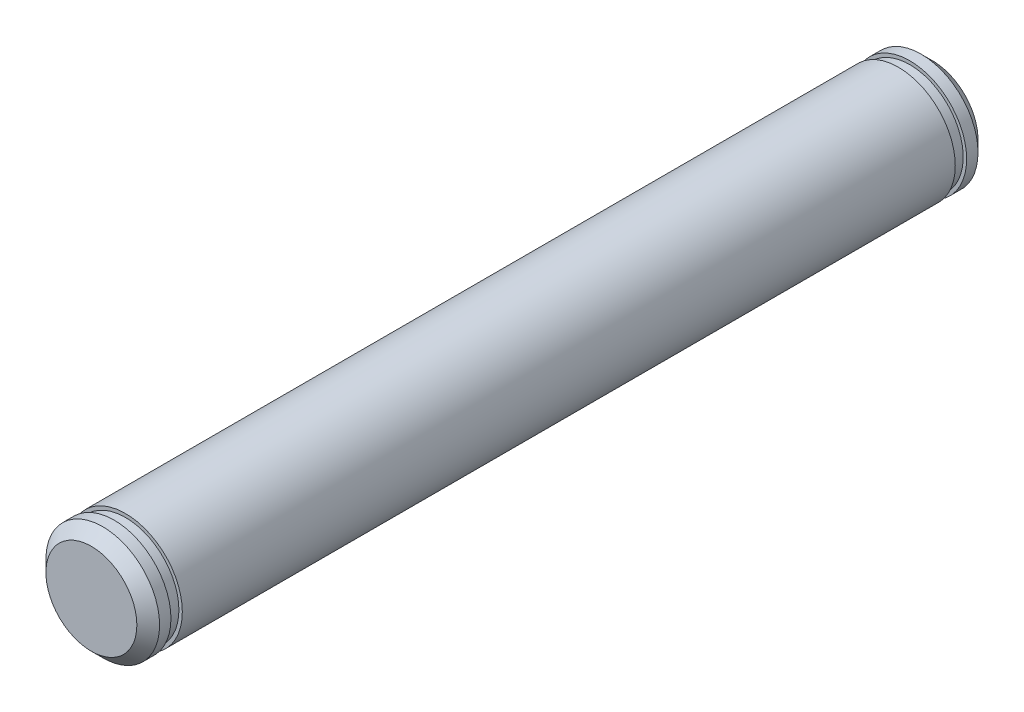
ISO-10303-21;
HEADER;
FILE_DESCRIPTION(('STEP AP214'),'2;1');
FILE_NAME('part.step','',(''),(''),'','','');
FILE_SCHEMA(('AUTOMOTIVE_DESIGN { 1 0 10303 214 1 1 1 1 }'));
ENDSEC;
DATA;
#1=APPLICATION_CONTEXT('core data for automotive mechanical design processes');
#2=APPLICATION_PROTOCOL_DEFINITION('international standard','automotive_design',2000,#1);
#3=PRODUCT_CONTEXT('',#1,'mechanical');
#4=PRODUCT('Part','Part','',(#3));
#5=PRODUCT_RELATED_PRODUCT_CATEGORY('part','',(#4));
#6=PRODUCT_DEFINITION_FORMATION('','',#4);
#7=PRODUCT_DEFINITION_CONTEXT('part definition',#1,'design');
#8=PRODUCT_DEFINITION('design','',#6,#7);
#9=PRODUCT_DEFINITION_SHAPE('','',#8);
#10=(LENGTH_UNIT() NAMED_UNIT(*) SI_UNIT(.MILLI.,.METRE.));
#11=(NAMED_UNIT(*) PLANE_ANGLE_UNIT() SI_UNIT($,.RADIAN.));
#12=(NAMED_UNIT(*) SI_UNIT($,.STERADIAN.) SOLID_ANGLE_UNIT());
#13=UNCERTAINTY_MEASURE_WITH_UNIT(LENGTH_MEASURE(1.E-05),#10,'distance_accuracy_value','');
#14=(GEOMETRIC_REPRESENTATION_CONTEXT(3) GLOBAL_UNCERTAINTY_ASSIGNED_CONTEXT((#13)) GLOBAL_UNIT_ASSIGNED_CONTEXT((#10,
#11,#12)) REPRESENTATION_CONTEXT('',''));
#15=CARTESIAN_POINT('',(0.,0.,0.));
#16=DIRECTION('',(0.,0.,1.));
#17=DIRECTION('',(1.,0.,0.));
#18=AXIS2_PLACEMENT_3D('',#15,#16,#17);
#19=CARTESIAN_POINT('',(0.,0.,34.));
#20=DIRECTION('',(0.,0.,1.));
#21=DIRECTION('',(1.,0.,0.));
#22=AXIS2_PLACEMENT_3D('',#19,#20,#21);
#23=PLANE('',#22);
#24=CARTESIAN_POINT('',(0.,0.,34.));
#25=DIRECTION('',(0.,0.,1.));
#26=DIRECTION('',(1.,0.,0.));
#27=AXIS2_PLACEMENT_3D('',#24,#25,#26);
#28=CIRCLE('',#27,5.);
#29=CARTESIAN_POINT('',(5.,0.,34.));
#30=VERTEX_POINT('',#29);
#31=EDGE_CURVE('E52',#30,#30,#28,.T.);
#32=ORIENTED_EDGE('',*,*,#31,.T.);
#33=EDGE_LOOP('',(#32));
#34=FACE_BOUND('',#33,.T.);
#35=CARTESIAN_POINT('',(0.,0.,34.));
#36=DIRECTION('',(0.,0.,1.));
#37=DIRECTION('',(1.,0.,0.));
#38=AXIS2_PLACEMENT_3D('',#35,#36,#37);
#39=CIRCLE('',#38,4.7);
#40=CARTESIAN_POINT('',(4.7,0.,34.));
#41=VERTEX_POINT('',#40);
#42=EDGE_CURVE('E58',#41,#41,#39,.T.);
#43=ORIENTED_EDGE('',*,*,#42,.F.);
#44=EDGE_LOOP('',(#43));
#45=FACE_BOUND('',#44,.T.);
#46=ADVANCED_FACE('F29',(#34,#45),#23,.T.);
#47=CARTESIAN_POINT('',(0.,0.,34.));
#48=DIRECTION('',(0.,0.,-1.));
#49=DIRECTION('',(-1.,0.,0.));
#50=AXIS2_PLACEMENT_3D('',#47,#48,#49);
#51=CYLINDRICAL_SURFACE('',#50,5.);
#52=ORIENTED_EDGE('',*,*,#31,.F.);
#53=EDGE_LOOP('',(#52));
#54=FACE_BOUND('',#53,.T.);
#55=CARTESIAN_POINT('',(0.,0.,-34.));
#56=DIRECTION('',(0.,0.,1.));
#57=DIRECTION('',(1.,0.,0.));
#58=AXIS2_PLACEMENT_3D('',#55,#56,#57);
#59=CIRCLE('',#58,5.);
#60=CARTESIAN_POINT('',(5.,0.,-34.));
#61=VERTEX_POINT('',#60);
#62=EDGE_CURVE('E64',#61,#61,#59,.T.);
#63=ORIENTED_EDGE('',*,*,#62,.T.);
#64=EDGE_LOOP('',(#63));
#65=FACE_BOUND('',#64,.T.);
#66=ADVANCED_FACE('F31',(#54,#65),#51,.T.);
#67=CARTESIAN_POINT('',(0.,0.,35.));
#68=DIRECTION('',(0.,0.,-1.));
#69=DIRECTION('',(-1.,0.,0.));
#70=AXIS2_PLACEMENT_3D('',#67,#68,#69);
#71=CYLINDRICAL_SURFACE('',#70,4.7);
#72=CARTESIAN_POINT('',(0.,0.,35.));
#73=DIRECTION('',(0.,0.,1.));
#74=DIRECTION('',(1.,0.,0.));
#75=AXIS2_PLACEMENT_3D('',#72,#73,#74);
#76=CIRCLE('',#75,4.7);
#77=CARTESIAN_POINT('',(4.7,0.,35.));
#78=VERTEX_POINT('',#77);
#79=EDGE_CURVE('E55',#78,#78,#76,.T.);
#80=ORIENTED_EDGE('',*,*,#79,.F.);
#81=EDGE_LOOP('',(#80));
#82=FACE_BOUND('',#81,.T.);
#83=ORIENTED_EDGE('',*,*,#42,.T.);
#84=EDGE_LOOP('',(#83));
#85=FACE_BOUND('',#84,.T.);
#86=ADVANCED_FACE('F94',(#82,#85),#71,.T.);
#87=CARTESIAN_POINT('',(0.,0.,35.));
#88=DIRECTION('',(0.,0.,1.));
#89=DIRECTION('',(1.,0.,0.));
#90=AXIS2_PLACEMENT_3D('',#87,#88,#89);
#91=PLANE('',#90);
#92=CARTESIAN_POINT('',(0.,0.,35.));
#93=DIRECTION('',(0.,0.,1.));
#94=DIRECTION('',(1.,0.,0.));
#95=AXIS2_PLACEMENT_3D('',#92,#93,#94);
#96=CIRCLE('',#95,5.);
#97=CARTESIAN_POINT('',(5.,0.,35.));
#98=VERTEX_POINT('',#97);
#99=EDGE_CURVE('E61',#98,#98,#96,.T.);
#100=ORIENTED_EDGE('',*,*,#99,.F.);
#101=EDGE_LOOP('',(#100));
#102=FACE_BOUND('',#101,.T.);
#103=ORIENTED_EDGE('',*,*,#79,.T.);
#104=EDGE_LOOP('',(#103));
#105=FACE_BOUND('',#104,.T.);
#106=ADVANCED_FACE('F100',(#102,#105),#91,.F.);
#107=CARTESIAN_POINT('',(0.,0.,37.));
#108=DIRECTION('',(0.,0.,-1.));
#109=DIRECTION('',(-1.,0.,0.));
#110=AXIS2_PLACEMENT_3D('',#107,#108,#109);
#111=CYLINDRICAL_SURFACE('',#110,5.);
#112=CARTESIAN_POINT('',(0.,0.,36.));
#113=DIRECTION('',(0.,0.,1.));
#114=DIRECTION('',(1.,0.,0.));
#115=AXIS2_PLACEMENT_3D('',#112,#113,#114);
#116=CIRCLE('',#115,5.);
#117=CARTESIAN_POINT('',(5.,0.,36.));
#118=VERTEX_POINT('',#117);
#119=EDGE_CURVE('E44',#118,#118,#116,.F.);
#120=ORIENTED_EDGE('',*,*,#119,.T.);
#121=EDGE_LOOP('',(#120));
#122=FACE_BOUND('',#121,.T.);
#123=ORIENTED_EDGE('',*,*,#99,.T.);
#124=EDGE_LOOP('',(#123));
#125=FACE_BOUND('',#124,.T.);
#126=ADVANCED_FACE('F102',(#122,#125),#111,.T.);
#127=CARTESIAN_POINT('',(0.,0.,37.));
#128=DIRECTION('',(0.,0.,1.));
#129=DIRECTION('',(1.,0.,0.));
#130=AXIS2_PLACEMENT_3D('',#127,#128,#129);
#131=PLANE('',#130);
#132=CARTESIAN_POINT('',(0.,0.,37.));
#133=DIRECTION('',(0.,0.,1.));
#134=DIRECTION('',(1.,0.,0.));
#135=AXIS2_PLACEMENT_3D('',#132,#133,#134);
#136=CIRCLE('',#135,3.99999999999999);
#137=CARTESIAN_POINT('',(3.99999999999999,0.,37.));
#138=VERTEX_POINT('',#137);
#139=EDGE_CURVE('E49',#138,#138,#136,.T.);
#140=ORIENTED_EDGE('',*,*,#139,.T.);
#141=EDGE_LOOP('',(#140));
#142=FACE_BOUND('',#141,.T.);
#143=ADVANCED_FACE('F105',(#142),#131,.T.);
#144=CARTESIAN_POINT('',(0.,0.,37.));
#145=DIRECTION('',(0.,0.,-1.));
#146=DIRECTION('',(-1.,0.,0.));
#147=AXIS2_PLACEMENT_3D('',#144,#145,#146);
#148=CONICAL_SURFACE('',#147,3.99999999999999,0.785398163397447);
#149=ORIENTED_EDGE('',*,*,#119,.F.);
#150=EDGE_LOOP('',(#149));
#151=FACE_BOUND('',#150,.T.);
#152=ORIENTED_EDGE('',*,*,#139,.F.);
#153=EDGE_LOOP('',(#152));
#154=FACE_BOUND('',#153,.T.);
#155=ADVANCED_FACE('F109',(#151,#154),#148,.T.);
#156=CARTESIAN_POINT('',(0.,0.,-34.));
#157=DIRECTION('',(0.,0.,-1.));
#158=DIRECTION('',(1.,0.,0.));
#159=AXIS2_PLACEMENT_3D('',#156,#157,#158);
#160=PLANE('',#159);
#161=CARTESIAN_POINT('',(0.,0.,-34.));
#162=DIRECTION('',(0.,0.,-1.));
#163=DIRECTION('',(-1.,0.,0.));
#164=AXIS2_PLACEMENT_3D('',#161,#162,#163);
#165=CIRCLE('',#164,4.7);
#166=CARTESIAN_POINT('',(-4.7,0.,-34.));
#167=VERTEX_POINT('',#166);
#168=EDGE_CURVE('E40',#167,#167,#165,.T.);
#169=ORIENTED_EDGE('',*,*,#168,.F.);
#170=EDGE_LOOP('',(#169));
#171=FACE_BOUND('',#170,.T.);
#172=ORIENTED_EDGE('',*,*,#62,.F.);
#173=EDGE_LOOP('',(#172));
#174=FACE_BOUND('',#173,.T.);
#175=ADVANCED_FACE('F86',(#171,#174),#160,.T.);
#176=CARTESIAN_POINT('',(0.,0.,-35.));
#177=DIRECTION('',(0.,0.,1.));
#178=DIRECTION('',(1.,0.,0.));
#179=AXIS2_PLACEMENT_3D('',#176,#177,#178);
#180=CYLINDRICAL_SURFACE('',#179,4.7);
#181=CARTESIAN_POINT('',(0.,0.,-35.));
#182=DIRECTION('',(0.,0.,-1.));
#183=DIRECTION('',(-1.,0.,0.));
#184=AXIS2_PLACEMENT_3D('',#181,#182,#183);
#185=CIRCLE('',#184,4.7);
#186=CARTESIAN_POINT('',(-4.7,0.,-35.));
#187=VERTEX_POINT('',#186);
#188=EDGE_CURVE('E67',#187,#187,#185,.F.);
#189=ORIENTED_EDGE('',*,*,#188,.T.);
#190=EDGE_LOOP('',(#189));
#191=FACE_BOUND('',#190,.T.);
#192=ORIENTED_EDGE('',*,*,#168,.T.);
#193=EDGE_LOOP('',(#192));
#194=FACE_BOUND('',#193,.T.);
#195=ADVANCED_FACE('F79',(#191,#194),#180,.T.);
#196=CARTESIAN_POINT('',(0.,0.,-37.));
#197=DIRECTION('',(0.,0.,1.));
#198=DIRECTION('',(1.,0.,0.));
#199=AXIS2_PLACEMENT_3D('',#196,#197,#198);
#200=CYLINDRICAL_SURFACE('',#199,5.);
#201=CARTESIAN_POINT('',(0.,0.,-36.));
#202=DIRECTION('',(0.,0.,-1.));
#203=DIRECTION('',(-1.,0.,0.));
#204=AXIS2_PLACEMENT_3D('',#201,#202,#203);
#205=CIRCLE('',#204,5.);
#206=CARTESIAN_POINT('',(-5.,0.,-36.));
#207=VERTEX_POINT('',#206);
#208=EDGE_CURVE('E36',#207,#207,#205,.F.);
#209=ORIENTED_EDGE('',*,*,#208,.T.);
#210=EDGE_LOOP('',(#209));
#211=FACE_BOUND('',#210,.T.);
#212=CARTESIAN_POINT('',(0.,0.,-35.));
#213=DIRECTION('',(0.,0.,1.));
#214=DIRECTION('',(1.,0.,0.));
#215=AXIS2_PLACEMENT_3D('',#212,#213,#214);
#216=CIRCLE('',#215,5.);
#217=CARTESIAN_POINT('',(5.,0.,-35.));
#218=VERTEX_POINT('',#217);
#219=EDGE_CURVE('E70',#218,#218,#216,.T.);
#220=ORIENTED_EDGE('',*,*,#219,.F.);
#221=EDGE_LOOP('',(#220));
#222=FACE_BOUND('',#221,.T.);
#223=ADVANCED_FACE('F76',(#211,#222),#200,.T.);
#224=CARTESIAN_POINT('',(0.,0.,-37.));
#225=DIRECTION('',(0.,0.,-1.));
#226=DIRECTION('',(1.,0.,0.));
#227=AXIS2_PLACEMENT_3D('',#224,#225,#226);
#228=PLANE('',#227);
#229=CARTESIAN_POINT('',(0.,0.,-37.));
#230=DIRECTION('',(0.,0.,-1.));
#231=DIRECTION('',(-1.,0.,0.));
#232=AXIS2_PLACEMENT_3D('',#229,#230,#231);
#233=CIRCLE('',#232,4.00000000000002);
#234=CARTESIAN_POINT('',(-4.00000000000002,0.,-37.));
#235=VERTEX_POINT('',#234);
#236=EDGE_CURVE('E10',#235,#235,#233,.T.);
#237=ORIENTED_EDGE('',*,*,#236,.T.);
#238=EDGE_LOOP('',(#237));
#239=FACE_BOUND('',#238,.T.);
#240=ADVANCED_FACE('F78',(#239),#228,.T.);
#241=CARTESIAN_POINT('',(0.,0.,-35.));
#242=DIRECTION('',(0.,0.,-1.));
#243=DIRECTION('',(1.,0.,0.));
#244=AXIS2_PLACEMENT_3D('',#241,#242,#243);
#245=PLANE('',#244);
#246=ORIENTED_EDGE('',*,*,#188,.F.);
#247=EDGE_LOOP('',(#246));
#248=FACE_BOUND('',#247,.T.);
#249=ORIENTED_EDGE('',*,*,#219,.T.);
#250=EDGE_LOOP('',(#249));
#251=FACE_BOUND('',#250,.T.);
#252=ADVANCED_FACE('F74',(#248,#251),#245,.F.);
#253=CARTESIAN_POINT('',(0.,0.,-36.));
#254=DIRECTION('',(0.,0.,1.));
#255=DIRECTION('',(1.,0.,0.));
#256=AXIS2_PLACEMENT_3D('',#253,#254,#255);
#257=CONICAL_SURFACE('',#256,5.,0.785398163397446);
#258=ORIENTED_EDGE('',*,*,#236,.F.);
#259=EDGE_LOOP('',(#258));
#260=FACE_BOUND('',#259,.T.);
#261=ORIENTED_EDGE('',*,*,#208,.F.);
#262=EDGE_LOOP('',(#261));
#263=FACE_BOUND('',#262,.T.);
#264=ADVANCED_FACE('F152',(#260,#263),#257,.T.);
#265=CLOSED_SHELL('',(#46,#66,#86,#106,#126,#143,#155,#175,#195,#223,#240,#252,#264));
#266=MANIFOLD_SOLID_BREP('B2',#265);
#267=ADVANCED_BREP_SHAPE_REPRESENTATION('',(#18,#266),#14);
#268=SHAPE_DEFINITION_REPRESENTATION(#9,#267);
ENDSEC;
END-ISO-10303-21;
